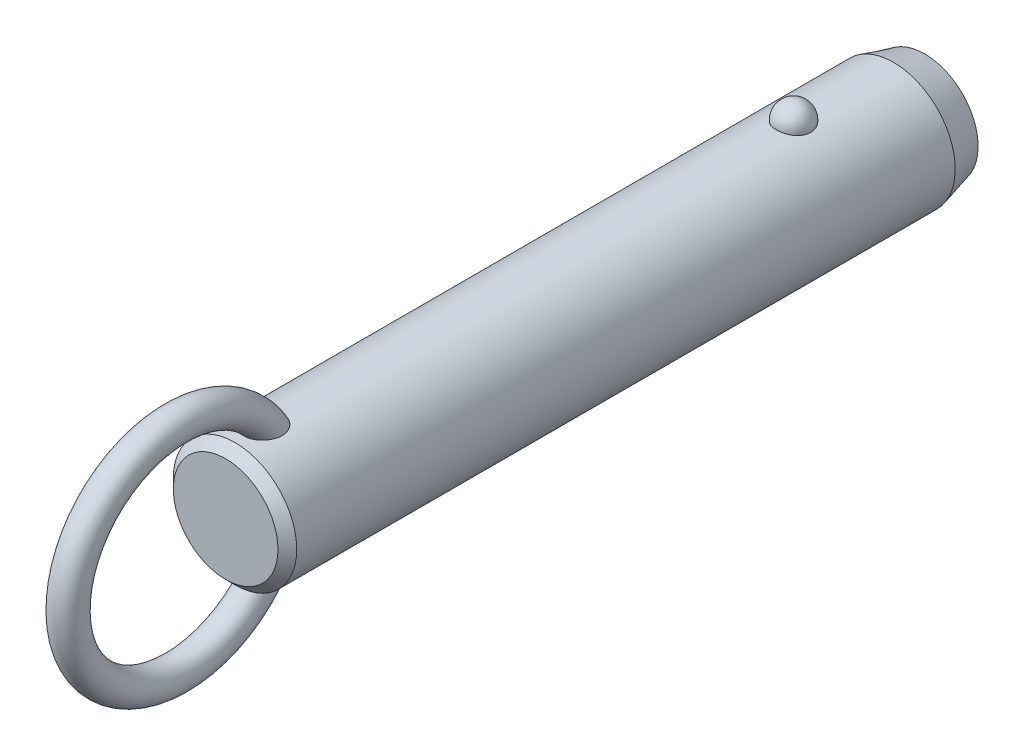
ISO-10303-21;
HEADER;
FILE_DESCRIPTION(('STEP AP214'),'2;1');
FILE_NAME('part.step','',(''),(''),'','','');
FILE_SCHEMA(('AUTOMOTIVE_DESIGN { 1 0 10303 214 1 1 1 1 }'));
ENDSEC;
DATA;
#1=APPLICATION_CONTEXT('core data for automotive mechanical design processes');
#2=APPLICATION_PROTOCOL_DEFINITION('international standard','automotive_design',2000,#1);
#3=PRODUCT_CONTEXT('',#1,'mechanical');
#4=PRODUCT('Part','Part','',(#3));
#5=PRODUCT_RELATED_PRODUCT_CATEGORY('part','',(#4));
#6=PRODUCT_DEFINITION_FORMATION('','',#4);
#7=PRODUCT_DEFINITION_CONTEXT('part definition',#1,'design');
#8=PRODUCT_DEFINITION('design','',#6,#7);
#9=PRODUCT_DEFINITION_SHAPE('','',#8);
#10=(LENGTH_UNIT() NAMED_UNIT(*) SI_UNIT(.MILLI.,.METRE.));
#11=(NAMED_UNIT(*) PLANE_ANGLE_UNIT() SI_UNIT($,.RADIAN.));
#12=(NAMED_UNIT(*) SI_UNIT($,.STERADIAN.) SOLID_ANGLE_UNIT());
#13=UNCERTAINTY_MEASURE_WITH_UNIT(LENGTH_MEASURE(1.E-05),#10,'distance_accuracy_value','');
#14=(GEOMETRIC_REPRESENTATION_CONTEXT(3) GLOBAL_UNCERTAINTY_ASSIGNED_CONTEXT((#13)) GLOBAL_UNIT_ASSIGNED_CONTEXT((#10,
#11,#12)) REPRESENTATION_CONTEXT('',''));
#15=CARTESIAN_POINT('',(0.,0.,0.));
#16=DIRECTION('',(0.,0.,1.));
#17=DIRECTION('',(1.,0.,0.));
#18=AXIS2_PLACEMENT_3D('',#15,#16,#17);
#19=CARTESIAN_POINT('',(0.,0.,61.));
#20=DIRECTION('',(0.,0.,-1.));
#21=DIRECTION('',(-1.,0.,0.));
#22=AXIS2_PLACEMENT_3D('',#19,#20,#21);
#23=CYLINDRICAL_SURFACE('',#22,7.9);
#24=CARTESIAN_POINT('',(2.1785689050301,7.59367088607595,-2.19999999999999));
#25=CARTESIAN_POINT('',(2.17856679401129,7.59367269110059,-2.07701843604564));
#26=CARTESIAN_POINT('',(2.16853481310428,7.59657145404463,-1.95401006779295));
#27=CARTESIAN_POINT('',(2.12864689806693,7.607843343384,-1.71147811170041));
#28=CARTESIAN_POINT('',(2.09878338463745,7.61621856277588,-1.59195587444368));
#29=CARTESIAN_POINT('',(2.0199931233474,7.63749180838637,-1.3598563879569));
#30=CARTESIAN_POINT('',(1.97107475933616,7.65038784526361,-1.24727610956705));
#31=CARTESIAN_POINT('',(1.85539377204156,7.67926115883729,-1.03213234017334));
#32=CARTESIAN_POINT('',(1.78863158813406,7.69523835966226,-0.929568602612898));
#33=CARTESIAN_POINT('',(1.63856494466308,7.7285848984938,-0.736786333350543));
#34=CARTESIAN_POINT('',(1.55518140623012,7.7459606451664,-0.646630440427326));
#35=CARTESIAN_POINT('',(1.37422937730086,7.78009978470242,-0.481747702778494));
#36=CARTESIAN_POINT('',(1.27666086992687,7.7968631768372,-0.407020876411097));
#37=CARTESIAN_POINT('',(1.07024728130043,7.82786153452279,-0.275278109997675));
#38=CARTESIAN_POINT('',(0.961434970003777,7.84210353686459,-0.218212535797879));
#39=CARTESIAN_POINT('',(0.735351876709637,7.86652194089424,-0.123146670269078));
#40=CARTESIAN_POINT('',(0.618082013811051,7.87669878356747,-0.0851443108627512));
#41=CARTESIAN_POINT('',(0.380637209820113,7.89170521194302,-0.0298158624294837));
#42=CARTESIAN_POINT('',(0.260550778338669,7.89662650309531,-0.0121347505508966));
#43=CARTESIAN_POINT('',(0.0190117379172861,7.90090003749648,0.00324379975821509));
#44=CARTESIAN_POINT('',(-0.10244074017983,7.90025280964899,0.000943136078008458));
#45=CARTESIAN_POINT('',(-0.341452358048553,7.89351056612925,-0.0233955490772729));
#46=CARTESIAN_POINT('',(-0.45904225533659,7.88749257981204,-0.0451545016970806));
#47=CARTESIAN_POINT('',(-0.688796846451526,7.87075812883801,-0.107408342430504));
#48=CARTESIAN_POINT('',(-0.800961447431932,7.86004158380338,-0.147903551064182));
#49=CARTESIAN_POINT('',(-1.01743634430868,7.83497131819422,-0.246799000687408));
#50=CARTESIAN_POINT('',(-1.12169791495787,7.82059709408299,-0.305300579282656));
#51=CARTESIAN_POINT('',(-1.31891765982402,7.78976470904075,-0.438549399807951));
#52=CARTESIAN_POINT('',(-1.41187469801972,7.77330633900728,-0.513298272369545));
#53=CARTESIAN_POINT('',(-1.58577142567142,7.73972434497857,-0.678622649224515));
#54=CARTESIAN_POINT('',(-1.66645140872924,7.72259402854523,-0.769470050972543));
#55=CARTESIAN_POINT('',(-1.81161503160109,7.68983776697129,-0.963538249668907));
#56=CARTESIAN_POINT('',(-1.87609753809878,7.6742119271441,-1.06675991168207));
#57=CARTESIAN_POINT('',(-1.98790138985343,7.6460202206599,-1.28401170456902));
#58=CARTESIAN_POINT('',(-2.03501994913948,7.63349104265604,-1.39815107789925));
#59=CARTESIAN_POINT('',(-2.10986724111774,7.6131449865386,-1.63301784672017));
#60=CARTESIAN_POINT('',(-2.1375965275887,7.60532797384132,-1.75374505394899));
#61=CARTESIAN_POINT('',(-2.17289256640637,7.59531950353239,-1.99782562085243));
#62=CARTESIAN_POINT('',(-2.18054294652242,7.59310471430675,-2.12116592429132));
#63=CARTESIAN_POINT('',(-2.17572919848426,7.59448538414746,-2.36741799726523));
#64=CARTESIAN_POINT('',(-2.1632656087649,7.59808068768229,-2.49032977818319));
#65=CARTESIAN_POINT('',(-2.11865035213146,7.61064035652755,-2.73161015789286));
#66=CARTESIAN_POINT('',(-2.08659579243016,7.61957823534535,-2.84999812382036));
#67=CARTESIAN_POINT('',(-2.00367799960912,7.64179982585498,-3.07955956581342));
#68=CARTESIAN_POINT('',(-1.9528140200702,7.65508371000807,-3.19073275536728));
#69=CARTESIAN_POINT('',(-1.83321113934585,7.68460381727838,-3.40337899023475));
#70=CARTESIAN_POINT('',(-1.76437735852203,7.70085556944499,-3.50479651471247));
#71=CARTESIAN_POINT('',(-1.61069526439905,7.73445734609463,-3.69446912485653));
#72=CARTESIAN_POINT('',(-1.52584634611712,7.75180741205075,-3.78272371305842));
#73=CARTESIAN_POINT('',(-1.34198059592,7.78574608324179,-3.94393987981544));
#74=CARTESIAN_POINT('',(-1.24291308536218,7.80233167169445,-4.01684434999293));
#75=CARTESIAN_POINT('',(-1.03352039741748,7.83281625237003,-4.14489386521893));
#76=CARTESIAN_POINT('',(-0.923196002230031,7.84671543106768,-4.20004014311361));
#77=CARTESIAN_POINT('',(-0.695822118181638,7.87011575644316,-4.29042017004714));
#78=CARTESIAN_POINT('',(-0.578872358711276,7.87966903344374,-4.32589112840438));
#79=CARTESIAN_POINT('',(-0.340410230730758,7.8935652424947,-4.37692226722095));
#80=CARTESIAN_POINT('',(-0.218898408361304,7.89790879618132,-4.39248482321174));
#81=CARTESIAN_POINT('',(0.022810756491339,7.90087453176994,-4.40314405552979));
#82=CARTESIAN_POINT('',(0.142990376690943,7.89960185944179,-4.39861683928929));
#83=CARTESIAN_POINT('',(0.380829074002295,7.89171262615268,-4.37008293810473));
#84=CARTESIAN_POINT('',(0.498488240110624,7.8850962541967,-4.34607694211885));
#85=CARTESIAN_POINT('',(0.727535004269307,7.86726442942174,-4.27939317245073));
#86=CARTESIAN_POINT('',(0.838944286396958,7.85606616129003,-4.236785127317));
#87=CARTESIAN_POINT('',(1.05295421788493,7.83025654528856,-4.13408348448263));
#88=CARTESIAN_POINT('',(1.15555431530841,7.81564498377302,-4.07398879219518));
#89=CARTESIAN_POINT('',(1.35076763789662,7.7843022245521,-3.93687432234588));
#90=CARTESIAN_POINT('',(1.4432046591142,7.76754209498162,-3.85961036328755));
#91=CARTESIAN_POINT('',(1.6139111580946,7.73387857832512,-3.69076949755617));
#92=CARTESIAN_POINT('',(1.6921781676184,7.71697516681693,-3.59919010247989));
#93=CARTESIAN_POINT('',(1.83380875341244,7.6845643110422,-3.40247278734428));
#94=CARTESIAN_POINT('',(1.89689280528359,7.66908588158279,-3.29712873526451));
#95=CARTESIAN_POINT('',(2.0047823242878,7.64159441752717,-3.07707931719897));
#96=CARTESIAN_POINT('',(2.0495945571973,7.62958010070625,-2.96237743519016));
#97=CARTESIAN_POINT('',(2.11580183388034,7.61146617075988,-2.74040519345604));
#98=CARTESIAN_POINT('',(2.13929812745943,7.60484503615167,-2.63379846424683));
#99=CARTESIAN_POINT('',(2.17068242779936,7.59594664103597,-2.41813481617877));
#100=CARTESIAN_POINT('',(2.17857077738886,7.59366928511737,-2.30907795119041));
#101=CARTESIAN_POINT('',(2.1785689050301,7.59367088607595,-2.19999999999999));
#102=B_SPLINE_CURVE_WITH_KNOTS('',3,(#24,#25,#26,#27,#28,#29,#30,#31,#32,#33,#34,#35,#36,#37,
#38,#39,#40,#41,#42,#43,#44,#45,#46,#47,#48,#49,#50,#51,#52,#53,#54,#55,#56,#57,#58,#59,#60,#61,
#62,#63,#64,#65,#66,#67,#68,#69,#70,#71,#72,#73,#74,#75,#76,#77,#78,#79,#80,#81,#82,#83,#84,#85,
#86,#87,#88,#89,#90,#91,#92,#93,#94,#95,#96,#97,#98,#99,#100,#101),.UNSPECIFIED.,.T.,.F.,(4,2,2,
2,2,2,2,2,2,2,2,2,2,2,2,2,2,2,2,2,2,2,2,2,2,2,2,2,2,2,2,2,2,2,2,2,2,2,4),(0.,0.368552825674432,
0.737246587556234,1.10577831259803,1.4743009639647,1.84462067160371,2.21494081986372,
2.58421058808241,2.95344028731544,3.31611630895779,3.67875788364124,4.03628044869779,
4.39380913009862,4.75338791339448,5.11300280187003,5.47939989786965,5.8458226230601,
6.21639834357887,6.58696347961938,6.9559827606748,7.32499216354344,7.69218715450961,
8.05939671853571,8.42858578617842,8.79778880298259,9.16834203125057,9.5388695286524,
9.90482699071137,10.2707407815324,10.6298333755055,10.9889132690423,11.3466585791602,
11.7044262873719,12.0676511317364,12.4309391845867,12.8004764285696,13.1698767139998,
13.4967701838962,13.8236564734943),.UNSPECIFIED.);
#103=CARTESIAN_POINT('',(2.1785689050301,7.59367088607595,-2.19999999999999));
#104=VERTEX_POINT('',#103);
#105=EDGE_CURVE('E41',#104,#104,#102,.T.);
#106=ORIENTED_EDGE('',*,*,#105,.T.);
#107=EDGE_LOOP('',(#106));
#108=FACE_BOUND('',#107,.T.);
#109=CARTESIAN_POINT('',(0.,0.,69.3200000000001));
#110=DIRECTION('',(0.,0.,1.));
#111=DIRECTION('',(1.,0.,0.));
#112=AXIS2_PLACEMENT_3D('',#109,#110,#111);
#113=CIRCLE('',#112,7.9);
#114=CARTESIAN_POINT('',(7.9,0.,69.3200000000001));
#115=VERTEX_POINT('',#114);
#116=EDGE_CURVE('E10',#115,#115,#113,.F.);
#117=ORIENTED_EDGE('',*,*,#116,.T.);
#118=EDGE_LOOP('',(#117));
#119=FACE_BOUND('',#118,.T.);
#120=CARTESIAN_POINT('',(-0.630969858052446,-7.87476203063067,63.2124322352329));
#121=CARTESIAN_POINT('',(-0.734180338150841,-7.8664899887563,63.247285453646));
#122=CARTESIAN_POINT('',(-0.834476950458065,-7.85639291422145,63.2908160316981));
#123=CARTESIAN_POINT('',(-1.02620356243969,-7.83366343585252,63.3940948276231));
#124=CARTESIAN_POINT('',(-1.1176141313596,-7.82102565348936,63.4538775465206));
#125=CARTESIAN_POINT('',(-1.28877277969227,-7.79464922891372,63.5878390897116));
#126=CARTESIAN_POINT('',(-1.36854014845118,-7.78091246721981,63.661993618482));
#127=CARTESIAN_POINT('',(-1.5146152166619,-7.75380398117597,63.8224941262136));
#128=CARTESIAN_POINT('',(-1.58092966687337,-7.74043207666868,63.9088339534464));
#129=CARTESIAN_POINT('',(-1.70019064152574,-7.71512522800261,64.0929784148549));
#130=CARTESIAN_POINT('',(-1.75284037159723,-7.70322473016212,64.1909792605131));
#131=CARTESIAN_POINT('',(-1.84263464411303,-7.68224112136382,64.3941029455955));
#132=CARTESIAN_POINT('',(-1.87977299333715,-7.6731591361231,64.4992286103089));
#133=CARTESIAN_POINT('',(-1.94152728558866,-7.65777930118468,64.7232849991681));
#134=CARTESIAN_POINT('',(-1.96475471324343,-7.65179654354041,64.8426167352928));
#135=CARTESIAN_POINT('',(-1.99449499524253,-7.64409642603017,65.0834298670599));
#136=CARTESIAN_POINT('',(-2.0010005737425,-7.64238092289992,65.2049121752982));
#137=CARTESIAN_POINT('',(-1.99856014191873,-7.64302120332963,65.4683409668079));
#138=CARTESIAN_POINT('',(-1.98680021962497,-7.64611845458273,65.6102565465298));
#139=CARTESIAN_POINT('',(-1.9445777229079,-7.65696186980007,65.8911188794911));
#140=CARTESIAN_POINT('',(-1.91409393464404,-7.66471330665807,66.0300620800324));
#141=CARTESIAN_POINT('',(-1.82768670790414,-7.68582947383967,66.331939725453));
#142=CARTESIAN_POINT('',(-1.76772963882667,-7.70003779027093,66.493686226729));
#143=CARTESIAN_POINT('',(-1.65998501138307,-7.72371550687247,66.7276956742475));
#144=CARTESIAN_POINT('',(-1.621079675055,-7.73200670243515,66.8042974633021));
#145=CARTESIAN_POINT('',(-1.53727726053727,-7.74910377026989,66.9540798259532));
#146=CARTESIAN_POINT('',(-1.49238215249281,-7.75790947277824,67.0272615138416));
#147=CARTESIAN_POINT('',(-1.3739705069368,-7.77993338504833,67.2028838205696));
#148=CARTESIAN_POINT('',(-1.29690364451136,-7.79328473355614,67.3029557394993));
#149=CARTESIAN_POINT('',(-1.1288548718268,-7.81939266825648,67.4907147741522));
#150=CARTESIAN_POINT('',(-1.03789926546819,-7.83215032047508,67.5784247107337));
#151=CARTESIAN_POINT('',(-0.869532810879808,-7.85231710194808,67.7134148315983));
#152=CARTESIAN_POINT('',(-0.795716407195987,-7.86021093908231,67.765076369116));
#153=CARTESIAN_POINT('',(-0.640813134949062,-7.87434920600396,67.8563815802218));
#154=CARTESIAN_POINT('',(-0.559737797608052,-7.88059619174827,67.8960438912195));
#155=CARTESIAN_POINT('',(-0.406456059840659,-7.88984116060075,67.9543008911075));
#156=CARTESIAN_POINT('',(-0.335227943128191,-7.89321892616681,67.9753848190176));
#157=CARTESIAN_POINT('',(-0.19019307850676,-7.89804235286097,68.0054141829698));
#158=CARTESIAN_POINT('',(-0.11638863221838,-7.89948969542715,68.0143701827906));
#159=CARTESIAN_POINT('',(0.0318414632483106,-7.90028409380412,68.0192915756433));
#160=CARTESIAN_POINT('',(0.106268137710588,-7.89962640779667,68.0152276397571));
#161=CARTESIAN_POINT('',(0.253290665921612,-7.8962818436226,67.9944615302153));
#162=CARTESIAN_POINT('',(0.325885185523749,-7.8935935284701,67.9777504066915));
#163=CARTESIAN_POINT('',(0.481441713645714,-7.88577340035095,67.9287380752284));
#164=CARTESIAN_POINT('',(0.563611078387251,-7.88026321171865,67.894005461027));
#165=CARTESIAN_POINT('',(0.721129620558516,-7.86741729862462,67.8117965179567));
#166=CARTESIAN_POINT('',(0.796466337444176,-7.86007832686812,67.7642975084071));
#167=CARTESIAN_POINT('',(0.971456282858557,-7.84073285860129,67.636513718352));
#168=CARTESIAN_POINT('',(1.0671968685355,-7.82809461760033,67.5510047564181));
#169=CARTESIAN_POINT('',(1.24418921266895,-7.80192439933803,67.366232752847));
#170=CARTESIAN_POINT('',(1.32540832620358,-7.78839049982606,67.2669395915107));
#171=CARTESIAN_POINT('',(1.45199971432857,-7.76559693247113,67.0895760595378));
#172=CARTESIAN_POINT('',(1.50085649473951,-7.75626094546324,67.0139542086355));
#173=CARTESIAN_POINT('',(1.59197749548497,-7.7380727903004,66.8587428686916));
#174=CARTESIAN_POINT('',(1.63423919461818,-7.72922080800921,66.7791518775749));
#175=CARTESIAN_POINT('',(1.71222612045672,-7.71231959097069,66.6166640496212));
#176=CARTESIAN_POINT('',(1.7479451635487,-7.70427111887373,66.533764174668));
#177=CARTESIAN_POINT('',(1.81270113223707,-7.68929240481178,66.3652967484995));
#178=CARTESIAN_POINT('',(1.84173789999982,-7.68236218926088,66.2797291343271));
#179=CARTESIAN_POINT('',(1.89322698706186,-7.6698375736,66.1052870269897));
#180=CARTESIAN_POINT('',(1.91558744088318,-7.66426199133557,66.0163838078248));
#181=CARTESIAN_POINT('',(1.95281367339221,-7.65485915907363,65.8369696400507));
#182=CARTESIAN_POINT('',(1.96767946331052,-7.65103190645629,65.7464586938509));
#183=CARTESIAN_POINT('',(2.00021456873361,-7.64262981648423,65.4737320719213));
#184=CARTESIAN_POINT('',(2.00600691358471,-7.6410871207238,65.2897099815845));
#185=CARTESIAN_POINT('',(1.98445334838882,-7.64669564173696,64.9765019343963));
#186=CARTESIAN_POINT('',(1.96607186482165,-7.65149688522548,64.846618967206));
#187=CARTESIAN_POINT('',(1.90884967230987,-7.6659762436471,64.5916321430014));
#188=CARTESIAN_POINT('',(1.87002101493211,-7.67565148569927,64.466525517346));
#189=CARTESIAN_POINT('',(1.77063986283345,-7.69918471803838,64.2245401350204));
#190=CARTESIAN_POINT('',(1.7099372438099,-7.71307150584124,64.1077250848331));
#191=CARTESIAN_POINT('',(1.56733070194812,-7.74330306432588,63.8881444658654));
#192=CARTESIAN_POINT('',(1.48543692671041,-7.75964665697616,63.7853722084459));
#193=CARTESIAN_POINT('',(1.31346177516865,-7.79047523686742,63.6093800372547));
#194=CARTESIAN_POINT('',(1.22547278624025,-7.80495298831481,63.5341066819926));
#195=CARTESIAN_POINT('',(1.03724352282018,-7.83218597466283,63.4004864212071));
#196=CARTESIAN_POINT('',(0.937008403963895,-7.84494192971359,63.3421324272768));
#197=CARTESIAN_POINT('',(0.733599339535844,-7.86649045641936,63.2470270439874));
#198=CARTESIAN_POINT('',(0.630941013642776,-7.87547134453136,63.2092109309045));
#199=CARTESIAN_POINT('',(0.420465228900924,-7.88950708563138,63.1511160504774));
#200=CARTESIAN_POINT('',(0.312645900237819,-7.89456050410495,63.1308436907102));
#201=CARTESIAN_POINT('',(0.0960869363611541,-7.9001518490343,63.1084559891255));
#202=CARTESIAN_POINT('',(-0.0126341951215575,-7.90073226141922,63.1061698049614));
#203=CARTESIAN_POINT('',(-0.228766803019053,-7.89742350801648,63.1193678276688));
#204=CARTESIAN_POINT('',(-0.336180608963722,-7.89354403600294,63.1348134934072));
#205=CARTESIAN_POINT('',(-0.473410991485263,-7.88586871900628,63.1662177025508));
#206=CARTESIAN_POINT('',(-0.5052577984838,-7.88388984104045,63.1743541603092));
#207=CARTESIAN_POINT('',(-0.568481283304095,-7.87958326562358,63.1922083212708));
#208=CARTESIAN_POINT('',(-0.599857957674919,-7.87725556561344,63.2019260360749));
#209=CARTESIAN_POINT('',(-0.630969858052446,-7.87476203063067,63.2124322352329));
#210=B_SPLINE_CURVE_WITH_KNOTS('',3,(#120,#121,#122,#123,#124,#125,#126,#127,#128,#129,#130,
#131,#132,#133,#134,#135,#136,#137,#138,#139,#140,#141,#142,#143,#144,#145,#146,#147,#148,#149,
#150,#151,#152,#153,#154,#155,#156,#157,#158,#159,#160,#161,#162,#163,#164,#165,#166,#167,#168,
#169,#170,#171,#172,#173,#174,#175,#176,#177,#178,#179,#180,#181,#182,#183,#184,#185,#186,#187,
#188,#189,#190,#191,#192,#193,#194,#195,#196,#197,#198,#199,#200,#201,#202,#203,#204,#205,#206,
#207,#208,#209),.UNSPECIFIED.,.T.,.F.,(4,2,2,2,2,2,2,2,2,2,2,2,2,2,2,2,2,2,2,2,2,2,2,2,2,2,2,2,
2,2,2,2,2,2,2,2,2,2,2,2,2,2,2,2,4),(0.,0.327622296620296,0.655945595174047,0.983718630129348,
1.3113267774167,1.64554655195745,1.97989964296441,2.3436572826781,2.70757317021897,
3.13333684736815,3.55958380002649,4.07655306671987,4.3352789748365,4.59391999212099,
4.97382437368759,5.35301797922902,5.62348245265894,5.89352465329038,6.11565959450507,
6.3376009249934,6.56004255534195,6.78264174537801,7.04930844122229,7.31645206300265,
7.70130871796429,8.08701995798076,8.35824509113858,8.62957365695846,8.90115735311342,
9.17274746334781,9.44791855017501,9.7230892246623,10.2715298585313,10.6638393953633,
11.0559179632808,11.4507403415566,11.845374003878,12.1936425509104,12.5417649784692,
12.8695063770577,13.1973674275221,13.5221104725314,13.8461490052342,13.9449071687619,
14.0436660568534),.UNSPECIFIED.);
#211=CARTESIAN_POINT('',(-0.630969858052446,-7.87476203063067,63.2124322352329));
#212=VERTEX_POINT('',#211);
#213=EDGE_CURVE('E59',#212,#212,#210,.T.);
#214=ORIENTED_EDGE('',*,*,#213,.T.);
#215=EDGE_LOOP('',(#214));
#216=FACE_BOUND('',#215,.T.);
#217=CARTESIAN_POINT('',(-0.630969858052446,7.87476203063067,63.2124322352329));
#218=CARTESIAN_POINT('',(-0.528918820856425,7.88293636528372,63.1779798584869));
#219=CARTESIAN_POINT('',(-0.423745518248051,7.8893481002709,63.151915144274));
#220=CARTESIAN_POINT('',(-0.210236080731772,7.8979273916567,63.1172825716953));
#221=CARTESIAN_POINT('',(-0.10189380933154,7.90008607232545,63.1087513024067));
#222=CARTESIAN_POINT('',(0.114660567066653,7.89990877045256,63.1094570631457));
#223=CARTESIAN_POINT('',(0.222872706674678,7.89757640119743,63.1186798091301));
#224=CARTESIAN_POINT('',(0.436107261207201,7.88867538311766,63.1546525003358));
#225=CARTESIAN_POINT('',(0.541131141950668,7.8821087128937,63.1813942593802));
#226=CARTESIAN_POINT('',(0.745085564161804,7.86545130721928,63.2517561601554));
#227=CARTESIAN_POINT('',(0.844015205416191,7.85536005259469,63.2953787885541));
#228=CARTESIAN_POINT('',(1.03299167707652,7.83275153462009,63.3983796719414));
#229=CARTESIAN_POINT('',(1.12303841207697,7.8202342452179,63.4577580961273));
#230=CARTESIAN_POINT('',(1.29214734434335,7.79408219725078,63.5908647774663));
#231=CARTESIAN_POINT('',(1.37116907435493,7.78044359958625,63.6646436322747));
#232=CARTESIAN_POINT('',(1.51597677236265,7.75353170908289,63.8242353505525));
#233=CARTESIAN_POINT('',(1.58176261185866,7.74025841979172,63.9100483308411));
#234=CARTESIAN_POINT('',(1.70057386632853,7.71504069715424,64.093644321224));
#235=CARTESIAN_POINT('',(1.75320073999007,7.7031425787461,64.1916906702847));
#236=CARTESIAN_POINT('',(1.84293767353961,7.68216822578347,64.3948931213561));
#237=CARTESIAN_POINT('',(1.88004278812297,7.67309289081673,64.5000514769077));
#238=CARTESIAN_POINT('',(1.9417232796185,7.6577294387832,64.7241671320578));
#239=CARTESIAN_POINT('',(1.96491037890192,7.65175648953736,64.8435248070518));
#240=CARTESIAN_POINT('',(1.9945689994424,7.64407702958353,65.0843848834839));
#241=CARTESIAN_POINT('',(2.00103304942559,7.64237242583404,65.2058882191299));
#242=CARTESIAN_POINT('',(1.9985016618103,7.64303650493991,65.4693688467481));
#243=CARTESIAN_POINT('',(1.98669038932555,7.64614714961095,65.6113141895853));
#244=CARTESIAN_POINT('',(1.94436120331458,7.6570170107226,65.8922287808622));
#245=CARTESIAN_POINT('',(1.91382203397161,7.66478150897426,66.0311944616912));
#246=CARTESIAN_POINT('',(1.82728754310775,7.68592483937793,66.3331110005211));
#247=CARTESIAN_POINT('',(1.76725778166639,7.7001468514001,66.494872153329));
#248=CARTESIAN_POINT('',(1.65939700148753,7.72384204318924,66.7288914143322));
#249=CARTESIAN_POINT('',(1.62045187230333,7.73213852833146,66.8054942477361));
#250=CARTESIAN_POINT('',(1.53656684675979,7.74924489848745,66.9552737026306));
#251=CARTESIAN_POINT('',(1.49162892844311,7.75805461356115,67.0284514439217));
#252=CARTESIAN_POINT('',(1.37317698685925,7.78007342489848,67.2039520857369));
#253=CARTESIAN_POINT('',(1.29612360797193,7.79341423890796,67.3039112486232));
#254=CARTESIAN_POINT('',(1.12812043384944,7.81949839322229,67.4914508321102));
#255=CARTESIAN_POINT('',(1.03719688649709,7.83224280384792,67.5790540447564));
#256=CARTESIAN_POINT('',(0.868871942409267,7.85239026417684,67.7138971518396));
#257=CARTESIAN_POINT('',(0.795056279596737,7.86027769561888,67.7655113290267));
#258=CARTESIAN_POINT('',(0.640160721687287,7.87440222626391,67.8567201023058));
#259=CARTESIAN_POINT('',(0.559092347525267,7.88064188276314,67.8963333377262));
#260=CARTESIAN_POINT('',(0.405820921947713,7.8898738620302,67.9545056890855));
#261=CARTESIAN_POINT('',(0.334594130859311,7.89324577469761,67.9755523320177));
#262=CARTESIAN_POINT('',(0.189568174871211,7.89805733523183,68.0055070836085));
#263=CARTESIAN_POINT('',(0.115771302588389,7.89949866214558,68.0144257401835));
#264=CARTESIAN_POINT('',(-0.032435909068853,7.90028156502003,68.0192758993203));
#265=CARTESIAN_POINT('',(-0.106847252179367,7.89961843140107,68.0151782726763));
#266=CARTESIAN_POINT('',(-0.253834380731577,7.8962642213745,67.9943519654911));
#267=CARTESIAN_POINT('',(-0.326408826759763,7.89357170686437,67.9776143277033));
#268=CARTESIAN_POINT('',(-0.481962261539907,7.88574179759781,67.9285391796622));
#269=CARTESIAN_POINT('',(-0.564145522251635,7.88022507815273,67.8937638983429));
#270=CARTESIAN_POINT('',(-0.72168526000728,7.8673664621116,67.8114686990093));
#271=CARTESIAN_POINT('',(-0.797029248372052,7.8600213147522,67.7639260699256));
#272=CARTESIAN_POINT('',(-0.972044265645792,7.84066026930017,67.6360267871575));
#273=CARTESIAN_POINT('',(-1.06779803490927,7.82801274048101,67.5504436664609));
#274=CARTESIAN_POINT('',(-1.24480531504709,7.80182621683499,67.3655223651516));
#275=CARTESIAN_POINT('',(-1.3260261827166,7.78828530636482,67.2661540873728));
#276=CARTESIAN_POINT('',(-1.45259834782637,7.76548487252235,67.0886806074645));
#277=CARTESIAN_POINT('',(-1.50143856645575,7.75614818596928,67.0130252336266));
#278=CARTESIAN_POINT('',(-1.59252410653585,7.73796020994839,66.8577484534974));
#279=CARTESIAN_POINT('',(-1.63476690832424,7.72910910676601,66.7781255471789));
#280=CARTESIAN_POINT('',(-1.71271318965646,7.71221133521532,66.6155750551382));
#281=CARTESIAN_POINT('',(-1.74841047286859,7.70416543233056,66.5326444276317));
#282=CARTESIAN_POINT('',(-1.81311929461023,7.68919371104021,66.3641168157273));
#283=CARTESIAN_POINT('',(-1.84213067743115,7.6822679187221,66.2785197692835));
#284=CARTESIAN_POINT('',(-1.89356259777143,7.66975461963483,66.1040254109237));
#285=CARTESIAN_POINT('',(-1.91589165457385,7.66418586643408,66.0150995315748));
#286=CARTESIAN_POINT('',(-1.95305070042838,7.65479859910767,65.8356424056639));
#287=CARTESIAN_POINT('',(-1.96788069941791,7.65098008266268,65.7451111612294));
#288=CARTESIAN_POINT('',(-2.00030078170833,7.64260704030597,65.4723270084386));
#289=CARTESIAN_POINT('',(-2.00600576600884,7.64108760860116,65.2882718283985));
#290=CARTESIAN_POINT('',(-1.98428483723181,7.64673945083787,64.9750800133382));
#291=CARTESIAN_POINT('',(-1.96583698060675,7.6515575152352,64.8452400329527));
#292=CARTESIAN_POINT('',(-1.90848948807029,7.66606613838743,64.5903619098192));
#293=CARTESIAN_POINT('',(-1.86960376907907,7.67575338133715,64.465320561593));
#294=CARTESIAN_POINT('',(-1.7701342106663,7.69930132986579,64.2235009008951));
#295=CARTESIAN_POINT('',(-1.7094048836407,7.71318991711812,64.1067844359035));
#296=CARTESIAN_POINT('',(-1.56672953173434,7.74342495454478,63.8873404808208));
#297=CARTESIAN_POINT('',(-1.48478316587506,7.75977144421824,63.7846132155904));
#298=CARTESIAN_POINT('',(-1.31266325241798,7.79061163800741,63.6086431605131));
#299=CARTESIAN_POINT('',(-1.22456383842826,7.80509908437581,63.5333589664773));
#300=CARTESIAN_POINT('',(-1.03622400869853,7.83231881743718,63.3998659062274));
#301=CARTESIAN_POINT('',(-0.936015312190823,7.84505551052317,63.3416137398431));
#302=CARTESIAN_POINT('',(-0.798824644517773,7.85957802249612,63.2775408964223));
#303=CARTESIAN_POINT('',(-0.765787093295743,7.86286821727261,63.2632248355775));
#304=CARTESIAN_POINT('',(-0.698939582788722,7.86909211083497,63.236436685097));
#305=CARTESIAN_POINT('',(-0.66512963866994,7.8720258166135,63.2239645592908));
#306=CARTESIAN_POINT('',(-0.630969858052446,7.87476203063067,63.2124322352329));
#307=B_SPLINE_CURVE_WITH_KNOTS('',3,(#217,#218,#219,#220,#221,#222,#223,#224,#225,#226,#227,
#228,#229,#230,#231,#232,#233,#234,#235,#236,#237,#238,#239,#240,#241,#242,#243,#244,#245,#246,
#247,#248,#249,#250,#251,#252,#253,#254,#255,#256,#257,#258,#259,#260,#261,#262,#263,#264,#265,
#266,#267,#268,#269,#270,#271,#272,#273,#274,#275,#276,#277,#278,#279,#280,#281,#282,#283,#284,
#285,#286,#287,#288,#289,#290,#291,#292,#293,#294,#295,#296,#297,#298,#299,#300,#301,#302,#303,
#304,#305,#306),.UNSPECIFIED.,.T.,.F.,(4,2,2,2,2,2,2,2,2,2,2,2,2,2,2,2,2,2,2,2,2,2,2,2,2,2,2,2,
2,2,2,2,2,2,2,2,2,2,2,2,2,2,2,2,4),(0.,0.323920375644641,0.648516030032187,0.97285063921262,
1.29703380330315,1.62126473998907,1.94549915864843,2.27089401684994,2.5962920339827,
2.93059633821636,3.26500707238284,3.62881644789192,3.99278833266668,4.41865421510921,
4.84500434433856,5.36209210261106,5.62087589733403,5.87957448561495,6.25918598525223,
6.63808782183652,6.90846748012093,7.17842501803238,7.40052350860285,7.62242871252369,
7.84483086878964,8.06739077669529,8.33414615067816,8.60137921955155,8.98641454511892,
9.37230415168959,9.64358673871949,9.91497268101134,10.1866142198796,10.4582620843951,
10.7334745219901,11.0086865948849,11.5572126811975,11.9494246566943,12.3413699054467,
12.7359755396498,13.1305875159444,13.4791770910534,13.82687259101,13.9353013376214,
14.0437279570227),.UNSPECIFIED.);
#308=CARTESIAN_POINT('',(-0.630969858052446,7.87476203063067,63.2124322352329));
#309=VERTEX_POINT('',#308);
#310=EDGE_CURVE('E67',#309,#309,#307,.T.);
#311=ORIENTED_EDGE('',*,*,#310,.T.);
#312=EDGE_LOOP('',(#311));
#313=FACE_BOUND('',#312,.T.);
#314=CARTESIAN_POINT('',(0.,0.,-15.0000000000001));
#315=DIRECTION('',(0.,0.,-1.));
#316=DIRECTION('',(-1.,0.,0.));
#317=AXIS2_PLACEMENT_3D('',#314,#315,#316);
#318=CIRCLE('',#317,7.9);
#319=CARTESIAN_POINT('',(-7.9,0.,-15.0000000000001));
#320=VERTEX_POINT('',#319);
#321=EDGE_CURVE('E56',#320,#320,#318,.F.);
#322=ORIENTED_EDGE('',*,*,#321,.T.);
#323=EDGE_LOOP('',(#322));
#324=FACE_BOUND('',#323,.T.);
#325=ADVANCED_FACE('F37',(#108,#119,#216,#313,#324),#23,.T.);
#326=CARTESIAN_POINT('',(0.,0.,-19.));
#327=DIRECTION('',(0.,0.,-1.));
#328=DIRECTION('',(-1.,0.,0.));
#329=AXIS2_PLACEMENT_3D('',#326,#327,#328);
#330=PLANE('',#329);
#331=CARTESIAN_POINT('',(0.,0.,-19.));
#332=DIRECTION('',(0.,0.,-1.));
#333=DIRECTION('',(-1.,0.,0.));
#334=AXIS2_PLACEMENT_3D('',#331,#332,#333);
#335=CIRCLE('',#334,6.82820323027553);
#336=CARTESIAN_POINT('',(-6.82820323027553,0.,-19.));
#337=VERTEX_POINT('',#336);
#338=EDGE_CURVE('E66',#337,#337,#335,.T.);
#339=ORIENTED_EDGE('',*,*,#338,.T.);
#340=EDGE_LOOP('',(#339));
#341=FACE_BOUND('',#340,.T.);
#342=ADVANCED_FACE('F85',(#341),#330,.T.);
#343=CARTESIAN_POINT('',(0.,0.,-19.));
#344=DIRECTION('',(0.,0.,1.));
#345=DIRECTION('',(1.,0.,0.));
#346=AXIS2_PLACEMENT_3D('',#343,#344,#345);
#347=CONICAL_SURFACE('',#346,6.82820323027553,0.26179938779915);
#348=ORIENTED_EDGE('',*,*,#321,.F.);
#349=EDGE_LOOP('',(#348));
#350=FACE_BOUND('',#349,.T.);
#351=ORIENTED_EDGE('',*,*,#338,.F.);
#352=EDGE_LOOP('',(#351));
#353=FACE_BOUND('',#352,.T.);
#354=ADVANCED_FACE('F83',(#350,#353),#347,.T.);
#355=CARTESIAN_POINT('',(0.,0.,70.52));
#356=DIRECTION('',(0.,0.,1.));
#357=DIRECTION('',(1.,0.,0.));
#358=AXIS2_PLACEMENT_3D('',#355,#356,#357);
#359=PLANE('',#358);
#360=CARTESIAN_POINT('',(0.,0.,70.52));
#361=DIRECTION('',(0.,0.,1.));
#362=DIRECTION('',(1.,0.,0.));
#363=AXIS2_PLACEMENT_3D('',#360,#361,#362);
#364=CIRCLE('',#363,6.70000000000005);
#365=CARTESIAN_POINT('',(6.70000000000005,0.,70.52));
#366=VERTEX_POINT('',#365);
#367=EDGE_CURVE('E50',#366,#366,#364,.T.);
#368=ORIENTED_EDGE('',*,*,#367,.T.);
#369=EDGE_LOOP('',(#368));
#370=FACE_BOUND('',#369,.T.);
#371=ADVANCED_FACE('F77',(#370),#359,.T.);
#372=CARTESIAN_POINT('',(0.,0.,76.85));
#373=DIRECTION('',(1.,0.,0.));
#374=DIRECTION('',(0.,0.,-1.));
#375=AXIS2_PLACEMENT_3D('',#372,#373,#374);
#376=TOROIDAL_SURFACE('',#375,13.85,2.);
#377=ORIENTED_EDGE('',*,*,#310,.F.);
#378=EDGE_LOOP('',(#377));
#379=FACE_BOUND('',#378,.T.);
#380=ORIENTED_EDGE('',*,*,#213,.F.);
#381=EDGE_LOOP('',(#380));
#382=FACE_BOUND('',#381,.T.);
#383=ADVANCED_FACE('F73',(#379,#382),#376,.T.);
#384=CARTESIAN_POINT('',(0.,0.,70.52));
#385=DIRECTION('',(0.,0.,-1.));
#386=DIRECTION('',(-1.,0.,0.));
#387=AXIS2_PLACEMENT_3D('',#384,#385,#386);
#388=CONICAL_SURFACE('',#387,6.70000000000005,0.785398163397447);
#389=ORIENTED_EDGE('',*,*,#116,.F.);
#390=EDGE_LOOP('',(#389));
#391=FACE_BOUND('',#390,.T.);
#392=ORIENTED_EDGE('',*,*,#367,.F.);
#393=EDGE_LOOP('',(#392));
#394=FACE_BOUND('',#393,.T.);
#395=ADVANCED_FACE('F39',(#391,#394),#388,.T.);
#396=CARTESIAN_POINT('',(0.,7.9,-2.19999999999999));
#397=DIRECTION('',(0.,1.,0.));
#398=DIRECTION('',(0.,0.,-1.));
#399=AXIS2_PLACEMENT_3D('',#396,#397,#398);
#400=SPHERICAL_SURFACE('',#399,2.2);
#401=ORIENTED_EDGE('',*,*,#105,.F.);
#402=EDGE_LOOP('',(#401));
#403=FACE_BOUND('',#402,.T.);
#404=ADVANCED_FACE('F79',(#403),#400,.T.);
#405=CLOSED_SHELL('',(#325,#342,#354,#371,#383,#395,#404));
#406=MANIFOLD_SOLID_BREP('B2',#405);
#407=ADVANCED_BREP_SHAPE_REPRESENTATION('',(#18,#406),#14);
#408=SHAPE_DEFINITION_REPRESENTATION(#9,#407);
ENDSEC;
END-ISO-10303-21;
